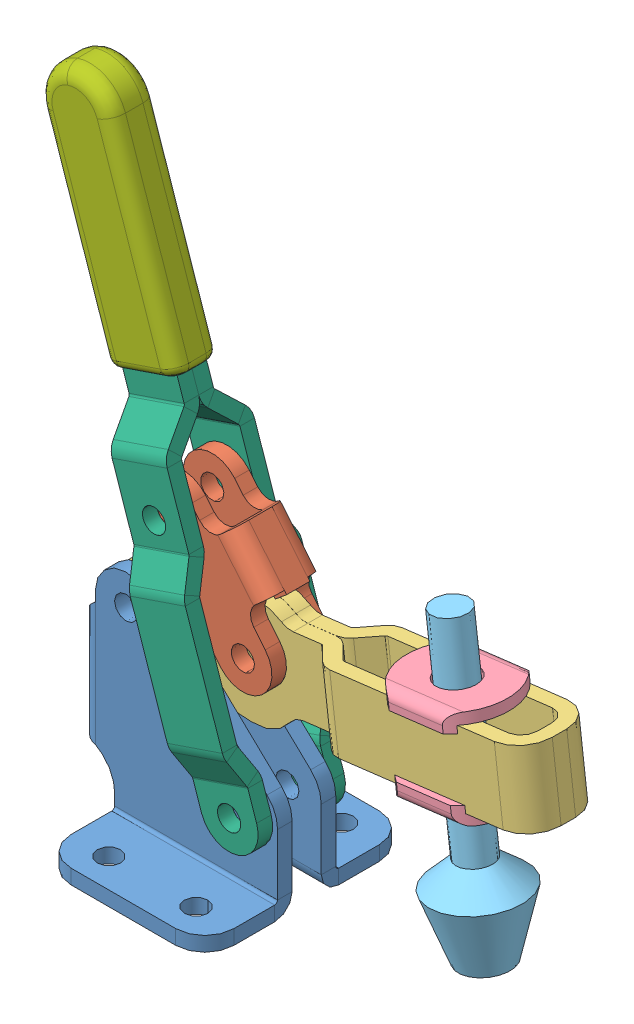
SolidWorks assembly collision_&.sldasm, configuration Default (file format 8000). Lengths in mm.
Overall size (117.02 139.51 44.45).
11 component instances, 7 part files, 10 mates.
Components (placement in the parent):
- base_&-2: base_&.SLDPRT [Default] at origin size (42.93 49.25 44.45)
- link_&-2: link_&.SLDPRT [Default] at (19.1438 65.2338 0) x (0.637827 -0.770179 0) z (0 0 1) size (38.1 19.05 12.7)
- hold-down sub-assy_&-1: hold-down sub-assy_&.SLDASM [Default] at (4.7398 32.3172 -6.35) x (0.992547 0.12186 0) z (0 0 1) size (96.01 63.5 19.3)
  - arm_&-1: arm_&.SLDPRT [Default] at origin size (96.01 23.62 15.88)
  - washer_&-1: washer_&.SLDPRT [Default] at (73.787 -2.286 0) x (0 0 -1) z (1 0 0) size (18.8 3.81 22.23)
  - washer_&-2: washer_&.SLDPRT [Default] at (73.787 18.161 0) x (0 0 -1) z (-1 0 0) size (18.8 3.81 22.23)
  - hold-down bolt_&-1: hold-down bolt_&.sldprt [Default] at (73.787 -32.766 0) size (19.3 63.5 19.3)
- handle sub-assy_&-1: handle sub-assy_&.sldasm [Default] at (9.0966 3.9197 -12.7) x (0.322325 -0.946629 0) z (0 0 1) size (132.59 16.51 25.4)
  - handle-half_&-1: handle-half_&.SLDPRT [Default] at (2.3468 22.924 12.7) size (130.68 12.7 12.7)
  - handle-half_&-2: handle-half_&.SLDPRT [Default] at (2.3468 35.624 0) x (1 0 0) z (0 0 -1) size (130.68 12.7 12.7)
  - sleeve_&-1: sleeve_&.sldprt [Default] at (-128.3362 22.924 3.175) size (52.77 16.51 10.16)
Mates (geometry in assembly coordinates):
- MateCoincident15: coincident aligned: plane of base_&-2 through (0 50.8 0) normal (0 0 1); plane of assembly through (0 0 0) normal (0 0 1)
- MateCoincident16: coincident anti-aligned: plane of base_&-2 through (0 0 -12.7) normal (0 -1 0); plane of assembly through (0 0 0) normal (0 1 0)
- MateCoincident17: coincident anti-aligned: plane of base_&-2 through (0 50.8 -12.7) normal (-1 0 0); plane of assembly through (0 0 0) normal (1 0 0)
- MateConcentric10: concentric aligned: cylinder of base_&-2 through (35.5179 17.145 -28.575) axis (0 0 1) radius 2.54; cylinder of handle sub-assy_&-1/handle-half_&-1 through (35.5179 17.145 -6.35) axis (0 0 1) radius 2.54
- MateCoincident20: coincident anti-aligned: plane of base_&-2 through (0 50.8 0) normal (0 0 1); plane of handle sub-assy_&-1/handle-half_&-1 through (43.5758 13.1807 0) normal (0 0 -1)
- MateConcentric11: concentric aligned: cylinder of handle sub-assy_&-1/handle-half_&-1 through (19.1438 65.2338 -6.35) axis (0 0 1) radius 2.54; cylinder of link_&-2 through (19.1438 65.2338 -12.7) axis (0 0 1) radius 2.54
- MateCoincident21: coincident anti-aligned: plane of handle sub-assy_&-1/handle-half_&-1 through (27.0379 61.7503 0) normal (0 0 -1); plane of link_&-2 through (10.2029 66.0742 0) normal (0 0 1)
- Concentric1: concentric aligned: cylinder of base_&-2 through (9.8818 42.545 -28.575) axis (0 0 1) radius 2.54; cylinder of hold-down sub-assy_&-1/arm_&-1 through (9.8818 42.545 -14.2875) axis (0 0 1) radius 2.54
- Coincident1: coincident anti-aligned: plane of base_&-2 through (42.926 50.8 -3.175) normal (0 0 -1); plane of hold-down sub-assy_&-1/arm_&-1 through (2.6375 32.0591 -3.175) normal (0 0 1)
- Concentric2: concentric aligned: cylinder of hold-down sub-assy_&-1/arm_&-1 through (35.3446 45.6712 -14.2875) axis (0 0 1) radius 2.54; cylinder of link_&-2 through (35.3446 45.6712 -12.7) axis (0 0 1) radius 2.54
